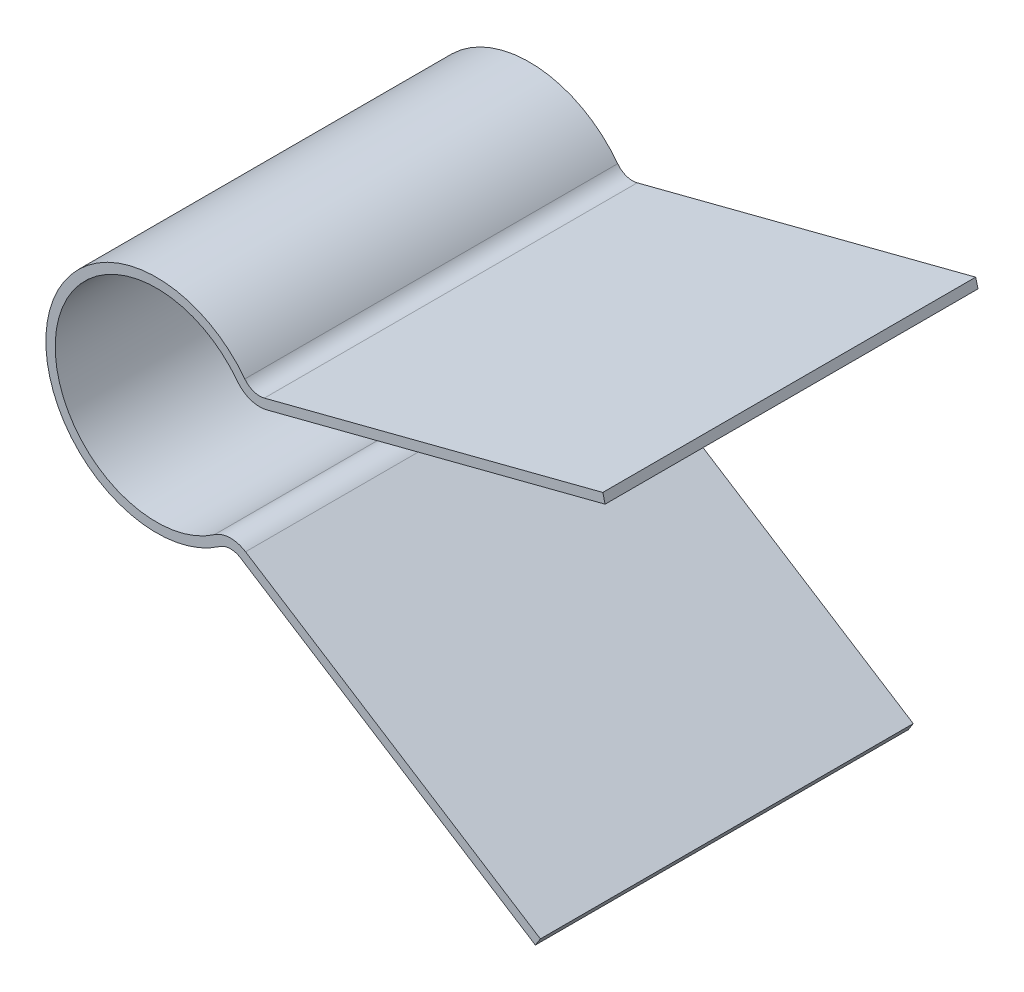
ISO-10303-21;
HEADER;
FILE_DESCRIPTION(('STEP AP214'),'2;1');
FILE_NAME('part.step','',(''),(''),'','','');
FILE_SCHEMA(('AUTOMOTIVE_DESIGN { 1 0 10303 214 1 1 1 1 }'));
ENDSEC;
DATA;
#1=APPLICATION_CONTEXT('core data for automotive mechanical design processes');
#2=APPLICATION_PROTOCOL_DEFINITION('international standard','automotive_design',2000,#1);
#3=PRODUCT_CONTEXT('',#1,'mechanical');
#4=PRODUCT('Part','Part','',(#3));
#5=PRODUCT_RELATED_PRODUCT_CATEGORY('part','',(#4));
#6=PRODUCT_DEFINITION_FORMATION('','',#4);
#7=PRODUCT_DEFINITION_CONTEXT('part definition',#1,'design');
#8=PRODUCT_DEFINITION('design','',#6,#7);
#9=PRODUCT_DEFINITION_SHAPE('','',#8);
#10=(LENGTH_UNIT() NAMED_UNIT(*) SI_UNIT(.MILLI.,.METRE.));
#11=(NAMED_UNIT(*) PLANE_ANGLE_UNIT() SI_UNIT($,.RADIAN.));
#12=(NAMED_UNIT(*) SI_UNIT($,.STERADIAN.) SOLID_ANGLE_UNIT());
#13=UNCERTAINTY_MEASURE_WITH_UNIT(LENGTH_MEASURE(1.E-05),#10,'distance_accuracy_value','');
#14=(GEOMETRIC_REPRESENTATION_CONTEXT(3) GLOBAL_UNCERTAINTY_ASSIGNED_CONTEXT((#13)) GLOBAL_UNIT_ASSIGNED_CONTEXT((#10,
#11,#12)) REPRESENTATION_CONTEXT('',''));
#15=CARTESIAN_POINT('',(0.,0.,0.));
#16=DIRECTION('',(0.,0.,1.));
#17=DIRECTION('',(1.,0.,0.));
#18=AXIS2_PLACEMENT_3D('',#15,#16,#17);
#19=CARTESIAN_POINT('',(-133.2655896,25.41017261,-8.4));
#20=DIRECTION('',(0.,0.,1.));
#21=DIRECTION('',(1.,0.,0.));
#22=AXIS2_PLACEMENT_3D('',#19,#20,#21);
#23=CYLINDRICAL_SURFACE('',#22,1.19999999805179);
#24=CARTESIAN_POINT('',(-133.2655896,25.41017261,-8.4));
#25=DIRECTION('',(0.,0.,1.));
#26=DIRECTION('',(1.,0.,0.));
#27=AXIS2_PLACEMENT_3D('',#24,#25,#26);
#28=CIRCLE('',#27,1.19999999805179);
#29=CARTESIAN_POINT('',(-132.965133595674,24.2483954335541,-8.4));
#30=VERTEX_POINT('',#29);
#31=CARTESIAN_POINT('',(-134.222513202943,24.6860889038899,-8.4));
#32=VERTEX_POINT('',#31);
#33=EDGE_CURVE('E109',#30,#32,#28,.F.);
#34=ORIENTED_EDGE('',*,*,#33,.F.);
#35=DIRECTION('',(0.,0.,1.));
#36=VECTOR('',#35,1.);
#37=CARTESIAN_POINT('',(-132.965133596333,24.2483954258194,0.));
#38=LINE('',#37,#36);
#39=CARTESIAN_POINT('',(-132.965133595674,24.2483954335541,7.6));
#40=VERTEX_POINT('',#39);
#41=EDGE_CURVE('E111',#30,#40,#38,.T.);
#42=ORIENTED_EDGE('',*,*,#41,.T.);
#43=CARTESIAN_POINT('',(-133.2655896,25.41017261,7.6));
#44=DIRECTION('',(0.,0.,1.));
#45=DIRECTION('',(1.,0.,0.));
#46=AXIS2_PLACEMENT_3D('',#43,#44,#45);
#47=CIRCLE('',#46,1.19999999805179);
#48=CARTESIAN_POINT('',(-134.222513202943,24.6860889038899,7.6));
#49=VERTEX_POINT('',#48);
#50=EDGE_CURVE('E17',#49,#40,#47,.T.);
#51=ORIENTED_EDGE('',*,*,#50,.F.);
#52=DIRECTION('',(0.,0.,1.));
#53=VECTOR('',#52,1.);
#54=CARTESIAN_POINT('',(-134.2225132,24.6860889,-0.400000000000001));
#55=LINE('',#54,#53);
#56=EDGE_CURVE('E177',#49,#32,#55,.F.);
#57=ORIENTED_EDGE('',*,*,#56,.T.);
#58=EDGE_LOOP('',(#34,#42,#51,#57));
#59=FACE_BOUND('',#58,.T.);
#60=ADVANCED_FACE('F14',(#59),#23,.T.);
#61=CARTESIAN_POINT('',(-104.229387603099,-26.9555524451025,0.));
#62=DIRECTION('',(0.968147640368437,0.250380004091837,0.));
#63=DIRECTION('',(-0.250380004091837,0.968147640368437,0.));
#64=AXIS2_PLACEMENT_3D('',#61,#62,#63);
#65=PLANE('',#64);
#66=DIRECTION('',(-0.250380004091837,0.968147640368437,0.));
#67=VECTOR('',#66,1.);
#68=CARTESIAN_POINT('',(-104.229387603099,-26.9555524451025,-8.4));
#69=LINE('',#68,#67);
#70=CARTESIAN_POINT('',(-118.543070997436,28.3913545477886,-8.4));
#71=VERTEX_POINT('',#70);
#72=CARTESIAN_POINT('',(-118.442918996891,28.0040954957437,-8.4));
#73=VERTEX_POINT('',#72);
#74=EDGE_CURVE('E183',#71,#73,#69,.F.);
#75=ORIENTED_EDGE('',*,*,#74,.F.);
#76=DIRECTION('',(0.,0.,1.));
#77=VECTOR('',#76,1.);
#78=CARTESIAN_POINT('',(-118.54307099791,28.391354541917,0.));
#79=LINE('',#78,#77);
#80=CARTESIAN_POINT('',(-118.543070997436,28.3913545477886,7.6));
#81=VERTEX_POINT('',#80);
#82=EDGE_CURVE('E169',#71,#81,#79,.T.);
#83=ORIENTED_EDGE('',*,*,#82,.T.);
#84=DIRECTION('',(-0.250380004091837,0.968147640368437,0.));
#85=VECTOR('',#84,1.);
#86=CARTESIAN_POINT('',(-104.229387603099,-26.9555524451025,7.6));
#87=LINE('',#86,#85);
#88=CARTESIAN_POINT('',(-118.442918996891,28.0040954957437,7.6));
#89=VERTEX_POINT('',#88);
#90=EDGE_CURVE('E186',#89,#81,#87,.T.);
#91=ORIENTED_EDGE('',*,*,#90,.F.);
#92=DIRECTION('',(0.,0.,1.));
#93=VECTOR('',#92,1.);
#94=CARTESIAN_POINT('',(-118.44291899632,28.0040954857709,0.));
#95=LINE('',#94,#93);
#96=EDGE_CURVE('E116',#89,#73,#95,.F.);
#97=ORIENTED_EDGE('',*,*,#96,.T.);
#98=EDGE_LOOP('',(#75,#83,#91,#97));
#99=FACE_BOUND('',#98,.T.);
#100=ADVANCED_FACE('F253',(#99),#65,.T.);
#101=CARTESIAN_POINT('',(-133.2655896,25.41017261,-8.4));
#102=DIRECTION('',(0.,0.,1.));
#103=DIRECTION('',(1.,0.,0.));
#104=AXIS2_PLACEMENT_3D('',#101,#102,#103);
#105=CYLINDRICAL_SURFACE('',#104,0.800000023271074);
#106=CARTESIAN_POINT('',(-133.2655896,25.41017261,-8.4));
#107=DIRECTION('',(0.,0.,1.));
#108=DIRECTION('',(1.,0.,0.));
#109=AXIS2_PLACEMENT_3D('',#106,#107,#108);
#110=CIRCLE('',#109,0.800000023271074);
#111=CARTESIAN_POINT('',(-133.903538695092,24.9274501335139,-8.4));
#112=VERTEX_POINT('',#111);
#113=CARTESIAN_POINT('',(-133.065285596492,24.6356544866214,-8.4));
#114=VERTEX_POINT('',#113);
#115=EDGE_CURVE('E181',#112,#114,#110,.T.);
#116=ORIENTED_EDGE('',*,*,#115,.F.);
#117=DIRECTION('',(0.,0.,1.));
#118=VECTOR('',#117,1.);
#119=CARTESIAN_POINT('',(-133.9035387,24.92745014,-0.400000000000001));
#120=LINE('',#119,#118);
#121=CARTESIAN_POINT('',(-133.903538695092,24.9274501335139,7.6));
#122=VERTEX_POINT('',#121);
#123=EDGE_CURVE('E166',#112,#122,#120,.T.);
#124=ORIENTED_EDGE('',*,*,#123,.T.);
#125=CARTESIAN_POINT('',(-133.2655896,25.41017261,7.6));
#126=DIRECTION('',(0.,0.,1.));
#127=DIRECTION('',(1.,0.,0.));
#128=AXIS2_PLACEMENT_3D('',#125,#126,#127);
#129=CIRCLE('',#128,0.800000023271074);
#130=CARTESIAN_POINT('',(-133.065285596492,24.6356544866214,7.6));
#131=VERTEX_POINT('',#130);
#132=EDGE_CURVE('E185',#131,#122,#129,.F.);
#133=ORIENTED_EDGE('',*,*,#132,.F.);
#134=DIRECTION('',(0.,0.,1.));
#135=VECTOR('',#134,1.);
#136=CARTESIAN_POINT('',(-133.065285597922,24.6356544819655,0.));
#137=LINE('',#136,#135);
#138=EDGE_CURVE('E115',#131,#114,#137,.F.);
#139=ORIENTED_EDGE('',*,*,#138,.T.);
#140=EDGE_LOOP('',(#116,#124,#133,#139));
#141=FACE_BOUND('',#140,.T.);
#142=ADVANCED_FACE('F251',(#141),#105,.F.);
#143=CARTESIAN_POINT('',(-137.6913613,22.06128547,-8.4));
#144=DIRECTION('',(0.,0.,1.));
#145=DIRECTION('',(1.,0.,0.));
#146=AXIS2_PLACEMENT_3D('',#143,#144,#145);
#147=CYLINDRICAL_SURFACE('',#146,4.35000002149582);
#148=CARTESIAN_POINT('',(-137.6913613,22.06128547,-8.4));
#149=DIRECTION('',(0.,0.,1.));
#150=DIRECTION('',(1.,0.,0.));
#151=AXIS2_PLACEMENT_3D('',#148,#149,#150);
#152=CIRCLE('',#151,4.35000002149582);
#153=CARTESIAN_POINT('',(-135.203399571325,18.493016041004,-8.4));
#154=VERTEX_POINT('',#153);
#155=EDGE_CURVE('E199',#154,#32,#152,.F.);
#156=ORIENTED_EDGE('',*,*,#155,.T.);
#157=ORIENTED_EDGE('',*,*,#56,.F.);
#158=CARTESIAN_POINT('',(-137.6913613,22.06128547,7.6));
#159=DIRECTION('',(0.,0.,1.));
#160=DIRECTION('',(1.,0.,0.));
#161=AXIS2_PLACEMENT_3D('',#158,#159,#160);
#162=CIRCLE('',#161,4.35000002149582);
#163=CARTESIAN_POINT('',(-135.203399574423,18.4930160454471,7.6));
#164=VERTEX_POINT('',#163);
#165=EDGE_CURVE('E108',#49,#164,#162,.T.);
#166=ORIENTED_EDGE('',*,*,#165,.T.);
#167=DIRECTION('',(0.,0.,-1.));
#168=VECTOR('',#167,1.);
#169=CARTESIAN_POINT('',(-135.203399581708,18.4930160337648,-0.400000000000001));
#170=LINE('',#169,#168);
#171=EDGE_CURVE('E144',#164,#154,#170,.T.);
#172=ORIENTED_EDGE('',*,*,#171,.T.);
#173=EDGE_LOOP('',(#156,#157,#166,#172));
#174=FACE_BOUND('',#173,.T.);
#175=ADVANCED_FACE('F214',(#174),#147,.F.);
#176=CARTESIAN_POINT('',(-14.2135313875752,54.9596479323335,0.));
#177=DIRECTION('',(-0.250380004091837,0.968147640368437,0.));
#178=DIRECTION('',(-0.968147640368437,-0.250380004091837,0.));
#179=AXIS2_PLACEMENT_3D('',#176,#177,#178);
#180=PLANE('',#179);
#181=DIRECTION('',(0.968147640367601,0.250380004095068,0.));
#182=VECTOR('',#181,1.);
#183=CARTESIAN_POINT('',(-132.9651336,24.24839544,-8.4));
#184=LINE('',#183,#182);
#185=EDGE_CURVE('E202',#30,#73,#184,.T.);
#186=ORIENTED_EDGE('',*,*,#185,.T.);
#187=ORIENTED_EDGE('',*,*,#96,.F.);
#188=DIRECTION('',(-0.968147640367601,-0.250380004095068,0.));
#189=VECTOR('',#188,1.);
#190=CARTESIAN_POINT('',(-118.442919,28.0040955,7.6));
#191=LINE('',#190,#189);
#192=EDGE_CURVE('E106',#89,#40,#191,.T.);
#193=ORIENTED_EDGE('',*,*,#192,.T.);
#194=ORIENTED_EDGE('',*,*,#41,.F.);
#195=EDGE_LOOP('',(#186,#187,#193,#194));
#196=FACE_BOUND('',#195,.T.);
#197=ADVANCED_FACE('F119',(#196),#180,.F.);
#198=CARTESIAN_POINT('',(-14.3136833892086,55.3469069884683,0.));
#199=DIRECTION('',(-0.250380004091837,0.968147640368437,0.));
#200=DIRECTION('',(-0.968147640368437,-0.250380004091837,0.));
#201=AXIS2_PLACEMENT_3D('',#198,#199,#200);
#202=PLANE('',#201);
#203=DIRECTION('',(-0.968147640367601,-0.250380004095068,0.));
#204=VECTOR('',#203,1.);
#205=CARTESIAN_POINT('',(-118.543071,28.39135455,-8.4));
#206=LINE('',#205,#204);
#207=EDGE_CURVE('E198',#71,#114,#206,.T.);
#208=ORIENTED_EDGE('',*,*,#207,.T.);
#209=ORIENTED_EDGE('',*,*,#138,.F.);
#210=DIRECTION('',(0.968147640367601,0.250380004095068,0.));
#211=VECTOR('',#210,1.);
#212=CARTESIAN_POINT('',(-133.0652856,24.63565449,7.6));
#213=LINE('',#212,#211);
#214=EDGE_CURVE('E121',#131,#81,#213,.T.);
#215=ORIENTED_EDGE('',*,*,#214,.T.);
#216=ORIENTED_EDGE('',*,*,#82,.F.);
#217=EDGE_LOOP('',(#208,#209,#215,#216));
#218=FACE_BOUND('',#217,.T.);
#219=ADVANCED_FACE('F246',(#218),#202,.T.);
#220=CARTESIAN_POINT('',(-137.6913613,22.06128547,-8.4));
#221=DIRECTION('',(0.,0.,1.));
#222=DIRECTION('',(1.,0.,0.));
#223=AXIS2_PLACEMENT_3D('',#220,#221,#222);
#224=CYLINDRICAL_SURFACE('',#223,4.74999999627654);
#225=ORIENTED_EDGE('',*,*,#123,.F.);
#226=CARTESIAN_POINT('',(-137.6913613,22.06128547,-8.4));
#227=DIRECTION('',(0.,0.,1.));
#228=DIRECTION('',(1.,0.,0.));
#229=AXIS2_PLACEMENT_3D('',#226,#227,#228);
#230=CIRCLE('',#229,4.74999999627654);
#231=CARTESIAN_POINT('',(-134.974621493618,18.1648993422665,-8.4));
#232=VERTEX_POINT('',#231);
#233=EDGE_CURVE('E196',#112,#232,#230,.T.);
#234=ORIENTED_EDGE('',*,*,#233,.T.);
#235=DIRECTION('',(0.,0.,-1.));
#236=VECTOR('',#235,1.);
#237=CARTESIAN_POINT('',(-134.974621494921,18.1648993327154,-0.400000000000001));
#238=LINE('',#237,#236);
#239=CARTESIAN_POINT('',(-134.974621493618,18.1648993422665,7.6));
#240=VERTEX_POINT('',#239);
#241=EDGE_CURVE('E160',#232,#240,#238,.F.);
#242=ORIENTED_EDGE('',*,*,#241,.T.);
#243=CARTESIAN_POINT('',(-137.6913613,22.06128547,7.6));
#244=DIRECTION('',(0.,0.,1.));
#245=DIRECTION('',(1.,0.,0.));
#246=AXIS2_PLACEMENT_3D('',#243,#244,#245);
#247=CIRCLE('',#246,4.74999999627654);
#248=EDGE_CURVE('E126',#240,#122,#247,.F.);
#249=ORIENTED_EDGE('',*,*,#248,.T.);
#250=EDGE_LOOP('',(#225,#234,#242,#249));
#251=FACE_BOUND('',#250,.T.);
#252=ADVANCED_FACE('F282',(#251),#224,.T.);
#253=CARTESIAN_POINT('',(-134.5170653,17.50866588,-8.4));
#254=DIRECTION('',(0.,0.,1.));
#255=DIRECTION('',(1.,0.,0.));
#256=AXIS2_PLACEMENT_3D('',#253,#254,#255);
#257=CYLINDRICAL_SURFACE('',#256,1.19999998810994);
#258=CARTESIAN_POINT('',(-134.5170653,17.50866588,-8.4));
#259=DIRECTION('',(0.,0.,1.));
#260=DIRECTION('',(1.,0.,0.));
#261=AXIS2_PLACEMENT_3D('',#258,#259,#260);
#262=CIRCLE('',#261,1.19999998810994);
#263=CARTESIAN_POINT('',(-133.872305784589,18.5207356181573,-8.4));
#264=VERTEX_POINT('',#263);
#265=EDGE_CURVE('E203',#264,#154,#262,.T.);
#266=ORIENTED_EDGE('',*,*,#265,.T.);
#267=ORIENTED_EDGE('',*,*,#171,.F.);
#268=CARTESIAN_POINT('',(-134.5170653,17.50866588,7.6));
#269=DIRECTION('',(0.,0.,1.));
#270=DIRECTION('',(1.,0.,0.));
#271=AXIS2_PLACEMENT_3D('',#268,#269,#270);
#272=CIRCLE('',#271,1.19999998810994);
#273=CARTESIAN_POINT('',(-133.872305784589,18.5207356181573,7.6));
#274=VERTEX_POINT('',#273);
#275=EDGE_CURVE('E123',#164,#274,#272,.F.);
#276=ORIENTED_EDGE('',*,*,#275,.T.);
#277=DIRECTION('',(0.,0.,1.));
#278=VECTOR('',#277,1.);
#279=CARTESIAN_POINT('',(-133.872305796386,18.5207356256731,0.));
#280=LINE('',#279,#278);
#281=EDGE_CURVE('E147',#274,#264,#280,.F.);
#282=ORIENTED_EDGE('',*,*,#281,.T.);
#283=EDGE_LOOP('',(#266,#267,#276,#282));
#284=FACE_BOUND('',#283,.T.);
#285=ADVANCED_FACE('F217',(#284),#257,.T.);
#286=CARTESIAN_POINT('',(0.,0.,7.6));
#287=DIRECTION('',(0.,0.,-1.));
#288=DIRECTION('',(-1.,0.,0.));
#289=AXIS2_PLACEMENT_3D('',#286,#287,#288);
#290=PLANE('',#289);
#291=ORIENTED_EDGE('',*,*,#165,.F.);
#292=ORIENTED_EDGE('',*,*,#50,.T.);
#293=ORIENTED_EDGE('',*,*,#192,.F.);
#294=ORIENTED_EDGE('',*,*,#90,.T.);
#295=ORIENTED_EDGE('',*,*,#214,.F.);
#296=ORIENTED_EDGE('',*,*,#132,.T.);
#297=ORIENTED_EDGE('',*,*,#248,.F.);
#298=CARTESIAN_POINT('',(-134.5170653,17.50866588,7.6));
#299=DIRECTION('',(0.,0.,1.));
#300=DIRECTION('',(1.,0.,0.));
#301=AXIS2_PLACEMENT_3D('',#298,#299,#300);
#302=CIRCLE('',#301,0.800000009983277);
#303=CARTESIAN_POINT('',(-134.087225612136,18.1833790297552,7.6));
#304=VERTEX_POINT('',#303);
#305=EDGE_CURVE('E194',#240,#304,#302,.F.);
#306=ORIENTED_EDGE('',*,*,#305,.T.);
#307=DIRECTION('',(0.843391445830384,-0.537299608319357,0.));
#308=VECTOR('',#307,1.);
#309=CARTESIAN_POINT('',(-30.4698886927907,-47.8281448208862,7.6));
#310=LINE('',#309,#308);
#311=CARTESIAN_POINT('',(-121.436353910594,10.1238849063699,7.6));
#312=VERTEX_POINT('',#311);
#313=EDGE_CURVE('E135',#304,#312,#310,.T.);
#314=ORIENTED_EDGE('',*,*,#313,.T.);
#315=DIRECTION('',(-0.53729952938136,-0.843391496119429,0.));
#316=VECTOR('',#315,1.);
#317=CARTESIAN_POINT('',(-121.2214341,10.46124149,7.6));
#318=LINE('',#317,#316);
#319=CARTESIAN_POINT('',(-121.221434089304,10.4612414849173,7.6));
#320=VERTEX_POINT('',#319);
#321=EDGE_CURVE('E142',#320,#312,#318,.T.);
#322=ORIENTED_EDGE('',*,*,#321,.F.);
#323=DIRECTION('',(0.843391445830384,-0.537299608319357,0.));
#324=VECTOR('',#323,1.);
#325=CARTESIAN_POINT('',(-30.2549688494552,-47.4907882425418,7.6));
#326=LINE('',#325,#324);
#327=EDGE_CURVE('E149',#320,#274,#326,.F.);
#328=ORIENTED_EDGE('',*,*,#327,.T.);
#329=ORIENTED_EDGE('',*,*,#275,.F.);
#330=EDGE_LOOP('',(#291,#292,#293,#294,#295,#296,#297,#306,#314,#322,#328,#329));
#331=FACE_BOUND('',#330,.T.);
#332=ADVANCED_FACE('F104',(#331),#290,.F.);
#333=CARTESIAN_POINT('',(0.,0.,-8.4));
#334=DIRECTION('',(0.,0.,-1.));
#335=DIRECTION('',(-1.,0.,0.));
#336=AXIS2_PLACEMENT_3D('',#333,#334,#335);
#337=PLANE('',#336);
#338=DIRECTION('',(0.843391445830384,-0.537299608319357,0.));
#339=VECTOR('',#338,1.);
#340=CARTESIAN_POINT('',(-30.4698886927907,-47.8281448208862,-8.4));
#341=LINE('',#340,#339);
#342=CARTESIAN_POINT('',(-121.43635391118,10.1238849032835,-8.4));
#343=VERTEX_POINT('',#342);
#344=CARTESIAN_POINT('',(-134.087225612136,18.1833790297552,-8.4));
#345=VERTEX_POINT('',#344);
#346=EDGE_CURVE('E138',#343,#345,#341,.F.);
#347=ORIENTED_EDGE('',*,*,#346,.T.);
#348=CARTESIAN_POINT('',(-134.5170653,17.50866588,-8.4));
#349=DIRECTION('',(0.,0.,1.));
#350=DIRECTION('',(1.,0.,0.));
#351=AXIS2_PLACEMENT_3D('',#348,#349,#350);
#352=CIRCLE('',#351,0.800000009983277);
#353=EDGE_CURVE('E165',#345,#232,#352,.T.);
#354=ORIENTED_EDGE('',*,*,#353,.T.);
#355=ORIENTED_EDGE('',*,*,#233,.F.);
#356=ORIENTED_EDGE('',*,*,#115,.T.);
#357=ORIENTED_EDGE('',*,*,#207,.F.);
#358=ORIENTED_EDGE('',*,*,#74,.T.);
#359=ORIENTED_EDGE('',*,*,#185,.F.);
#360=ORIENTED_EDGE('',*,*,#33,.T.);
#361=ORIENTED_EDGE('',*,*,#155,.F.);
#362=ORIENTED_EDGE('',*,*,#265,.F.);
#363=DIRECTION('',(0.843391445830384,-0.537299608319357,0.));
#364=VECTOR('',#363,1.);
#365=CARTESIAN_POINT('',(-30.2549688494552,-47.4907882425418,-8.4));
#366=LINE('',#365,#364);
#367=CARTESIAN_POINT('',(-121.221434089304,10.4612414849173,-8.4));
#368=VERTEX_POINT('',#367);
#369=EDGE_CURVE('E139',#264,#368,#366,.T.);
#370=ORIENTED_EDGE('',*,*,#369,.T.);
#371=DIRECTION('',(0.53729952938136,0.843391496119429,0.));
#372=VECTOR('',#371,1.);
#373=CARTESIAN_POINT('',(-121.4363539,10.12388491,-8.4));
#374=LINE('',#373,#372);
#375=EDGE_CURVE('E32',#343,#368,#374,.T.);
#376=ORIENTED_EDGE('',*,*,#375,.F.);
#377=EDGE_LOOP('',(#347,#354,#355,#356,#357,#358,#359,#360,#361,#362,#370,#376));
#378=FACE_BOUND('',#377,.T.);
#379=ADVANCED_FACE('F211',(#378),#337,.T.);
#380=CARTESIAN_POINT('',(-134.5170653,17.50866588,-8.4));
#381=DIRECTION('',(0.,0.,1.));
#382=DIRECTION('',(1.,0.,0.));
#383=AXIS2_PLACEMENT_3D('',#380,#381,#382);
#384=CYLINDRICAL_SURFACE('',#383,0.800000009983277);
#385=ORIENTED_EDGE('',*,*,#353,.F.);
#386=DIRECTION('',(0.,0.,1.));
#387=VECTOR('',#386,1.);
#388=CARTESIAN_POINT('',(-134.087225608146,18.1833790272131,0.));
#389=LINE('',#388,#387);
#390=EDGE_CURVE('E155',#345,#304,#389,.T.);
#391=ORIENTED_EDGE('',*,*,#390,.T.);
#392=ORIENTED_EDGE('',*,*,#305,.F.);
#393=ORIENTED_EDGE('',*,*,#241,.F.);
#394=EDGE_LOOP('',(#385,#391,#392,#393));
#395=FACE_BOUND('',#394,.T.);
#396=ADVANCED_FACE('F272',(#395),#384,.F.);
#397=CARTESIAN_POINT('',(-30.2549688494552,-47.4907882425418,0.));
#398=DIRECTION('',(-0.537299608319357,-0.843391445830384,0.));
#399=DIRECTION('',(0.843391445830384,-0.537299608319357,0.));
#400=AXIS2_PLACEMENT_3D('',#397,#398,#399);
#401=PLANE('',#400);
#402=ORIENTED_EDGE('',*,*,#369,.F.);
#403=ORIENTED_EDGE('',*,*,#281,.F.);
#404=ORIENTED_EDGE('',*,*,#327,.F.);
#405=DIRECTION('',(0.,0.,1.));
#406=VECTOR('',#405,1.);
#407=CARTESIAN_POINT('',(-121.221434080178,10.4612414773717,0.));
#408=LINE('',#407,#406);
#409=EDGE_CURVE('E23',#320,#368,#408,.F.);
#410=ORIENTED_EDGE('',*,*,#409,.T.);
#411=EDGE_LOOP('',(#402,#403,#404,#410));
#412=FACE_BOUND('',#411,.T.);
#413=ADVANCED_FACE('F221',(#412),#401,.F.);
#414=CARTESIAN_POINT('',(-30.4698886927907,-47.8281448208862,0.));
#415=DIRECTION('',(-0.537299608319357,-0.843391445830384,0.));
#416=DIRECTION('',(0.843391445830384,-0.537299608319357,0.));
#417=AXIS2_PLACEMENT_3D('',#414,#415,#416);
#418=PLANE('',#417);
#419=ORIENTED_EDGE('',*,*,#346,.F.);
#420=DIRECTION('',(0.,0.,1.));
#421=VECTOR('',#420,1.);
#422=CARTESIAN_POINT('',(-121.436353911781,10.1238849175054,0.));
#423=LINE('',#422,#421);
#424=EDGE_CURVE('E9',#343,#312,#423,.T.);
#425=ORIENTED_EDGE('',*,*,#424,.T.);
#426=ORIENTED_EDGE('',*,*,#313,.F.);
#427=ORIENTED_EDGE('',*,*,#390,.F.);
#428=EDGE_LOOP('',(#419,#425,#426,#427));
#429=FACE_BOUND('',#428,.T.);
#430=ADVANCED_FACE('F262',(#429),#418,.T.);
#431=CARTESIAN_POINT('',(-90.9664652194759,57.9520297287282,0.));
#432=DIRECTION('',(0.843391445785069,-0.537299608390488,0.));
#433=DIRECTION('',(0.537299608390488,0.843391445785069,0.));
#434=AXIS2_PLACEMENT_3D('',#431,#432,#433);
#435=PLANE('',#434);
#436=ORIENTED_EDGE('',*,*,#375,.T.);
#437=ORIENTED_EDGE('',*,*,#409,.F.);
#438=ORIENTED_EDGE('',*,*,#321,.T.);
#439=ORIENTED_EDGE('',*,*,#424,.F.);
#440=EDGE_LOOP('',(#436,#437,#438,#439));
#441=FACE_BOUND('',#440,.T.);
#442=ADVANCED_FACE('F225',(#441),#435,.T.);
#443=CLOSED_SHELL('',(#60,#100,#142,#175,#197,#219,#252,#285,#332,#379,#396,#413,#430,#442));
#444=MANIFOLD_SOLID_BREP('B1',#443);
#445=ADVANCED_BREP_SHAPE_REPRESENTATION('',(#18,#444),#14);
#446=SHAPE_DEFINITION_REPRESENTATION(#9,#445);
ENDSEC;
END-ISO-10303-21;
